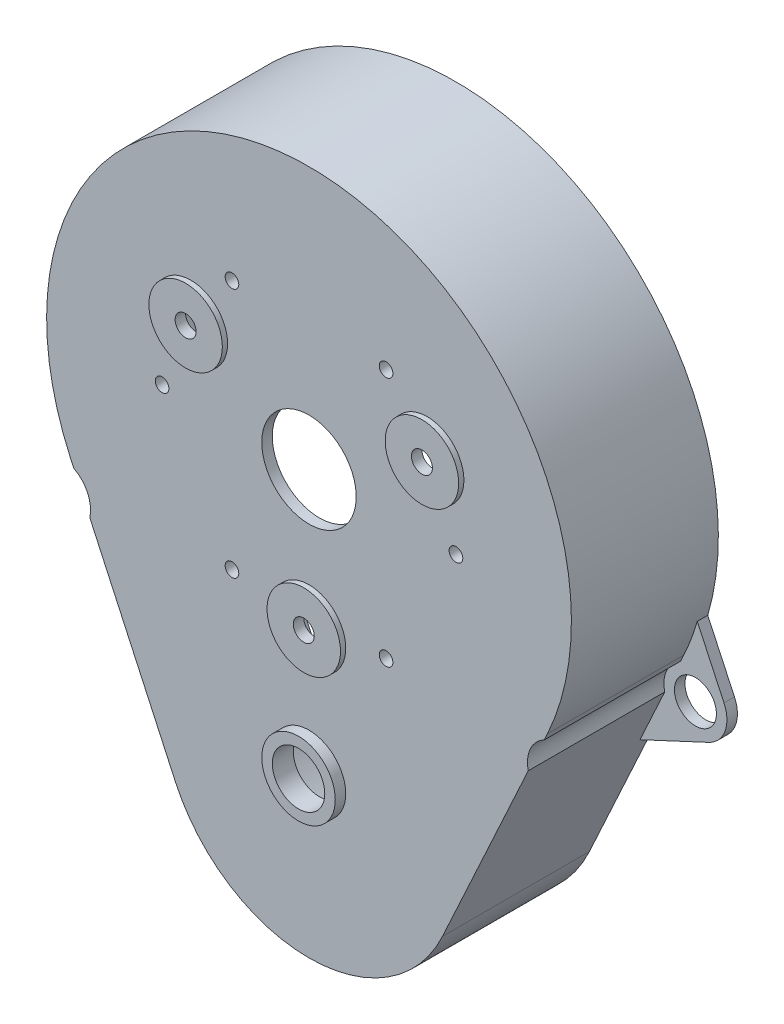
from build123d import *

# Parameters (mm, degrees)
BASE_EXTRUSION_DEPTH         = 14
COQUE1_T                     = -1
ESQUISSE2_R                  = 2
BOSS_EXTRU_1_DEPTH           = 1
ENL_V_MAT_EXTRU_1_DEPTH      = 51.121569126
ENL_V_MAT_EXTRU_2_DEPTH      = 51.121569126
ESQUISSE5_R                  = 0.65
ENL_V_MAT_EXTRU_3_DEPTH      = 51.121569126
ESQUISSE6_R                  = 2.5
ENL_V_MAT_EXTRU_4_DEPTH      = 51.121569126
ESQUISSE7_R                  = 4.5
ENL_V_MAT_EXTRU_5_DEPTH      = 51.121569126
ESQUISSE8_R                  = 3.5
ENL_V_MAT_EXTRU_6_DEPTH      = 0.5
R_P_TITION_CIRCULAIRE1_COUNT = 3
ESQUISSE9_R                  = 3.5
BOSS_EXTRU_2_DEPTH           = 0.5
ESQUISSE10_R                 = 3.5
ESQUISSE10_R_2               = 2.5
BOSS_EXTRU_3_DEPTH           = 1
ESQUISSE11_R                 = 1
ENL_V_MAT_EXTRU_7_DEPTH      = 51.253573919
R_P_TITION_CIRCULAIRE2_COUNT = 3


with BuildPart() as part:
    # Esquisse1 → Base-Extrusion (new body)
    with BuildSketch(Plane.XY):
        with BuildLine():
            Line((12.716641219, -32.155513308), (22.708287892, -10.456273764))
            ThreePointArc((22.708287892, -10.456273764), (0, 25), (-22.708287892, -10.456273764))
            Line((-22.708287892, -10.456273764), (-12.716641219, -32.155513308))
            ThreePointArc((-12.716641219, -32.155513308), (0, -40.3), (12.716641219, -32.155513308))
        make_face()
    extrude(amount=BASE_EXTRUSION_DEPTH)

    # Coque1
    coque1_openings = [part.faces().sort_by_distance(p)[0] for p in [
        (0, -5.432281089, 0),
    ]]
    offset(amount=COQUE1_T, openings=coque1_openings, kind=Kind.INTERSECTION)

    # Esquisse2 → Boss.-Extru.1 (add)
    # profile 1 of 2: a face of its own
    with BuildSketch(Plane(origin=(0, 0, 0), x_dir=(-1, 0, 0), z_dir=(0, 0, -1))):
        with BuildLine():
            Line((23.991621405, -7.028662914), (26.534621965, -12.482145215))
            ThreePointArc((26.534621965, -12.482145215), (26.634776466, -14.77606043), (25.083553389, -16.468923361))
            Line((25.083553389, -16.468923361), (18.53323976, -19.52338477))
            Line((18.53323976, -19.52338477), (22.708287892, -10.456273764))
            ThreePointArc((22.708287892, -10.456273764), (23.41276385, -8.765984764), (23.991621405, -7.028662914))
        make_face()
        with Locations((23.815698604, -13.75)):
            Circle(ESQUISSE2_R, mode=Mode.SUBTRACT)
    # profile 2 of 2: a face of its own
    with BuildSketch(Plane(origin=(0, 0, 0), x_dir=(-1, 0, 0), z_dir=(0, 0, -1))):
        with BuildLine():
            Line((-25.083553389, -16.468923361), (-18.53323976, -19.52338477))
            Line((-18.53323976, -19.52338477), (-22.708287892, -10.456273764))
            ThreePointArc((-22.708287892, -10.456273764), (-23.41276385, -8.765984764), (-23.991621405, -7.028662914))
            Line((-23.991621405, -7.028662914), (-26.534621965, -12.482145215))
            ThreePointArc((-26.534621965, -12.482145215), (-26.634776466, -14.77606043), (-25.083553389, -16.468923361))
        make_face()
        with Locations((-23.815698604, -13.75)):
            Circle(ESQUISSE2_R, mode=Mode.SUBTRACT)
    extrude(amount=-BOSS_EXTRU_1_DEPTH)

    # Esquisse3 → Enl_v. mat.-Extru.1 (cut, through all)
    with BuildSketch(Plane.XY.offset(1)):
        with BuildLine():
            Line((20.888723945, -14.407890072), (22.412656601, -11.098307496))
            ThreePointArc((22.412656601, -11.098307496), (21.090704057, -12.495247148), (20.888723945, -14.407890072))
        make_face()
    extrude(amount=ENL_V_MAT_EXTRU_1_DEPTH, mode=Mode.SUBTRACT)

    # Esquisse4 → Enl_v. mat.-Extru.2 (cut, through all)
    with BuildSketch(Plane.XY.offset(1)):
        with BuildLine():
            Line((-22.412656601, -11.098307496), (-20.888723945, -14.407890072))
            ThreePointArc((-20.888723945, -14.407890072), (-21.090704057, -12.495247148), (-22.412656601, -11.098307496))
        make_face()
    extrude(amount=ENL_V_MAT_EXTRU_2_DEPTH, mode=Mode.SUBTRACT)

    # Esquisse5 → Enl_v. mat.-Extru.3 (cut, through all)
    with BuildSketch(Plane(origin=(0, 0, 13), x_dir=(-1, 0, 0), z_dir=(0, 0, -1))):
        with Locations((7.3425881, 11.92)):
            Circle(ESQUISSE5_R)
        with Locations((14, 0)):
            Circle(ESQUISSE5_R)
        with Locations((7.3425881, -11.92)):
            Circle(ESQUISSE5_R)
        with Locations((-7.3425881, -11.92)):
            Circle(ESQUISSE5_R)
        with Locations((-14, 0)):
            Circle(ESQUISSE5_R)
        with Locations((-7.3425881, 11.92)):
            Circle(ESQUISSE5_R)
    extrude(amount=-ENL_V_MAT_EXTRU_3_DEPTH, mode=Mode.SUBTRACT)

    # Esquisse6 → Enl_v. mat.-Extru.4 (cut, through all)
    with BuildSketch(Plane(origin=(0, 0, 13), x_dir=(-1, 0, 0), z_dir=(0, 0, -1))):
        with Locations((0, -25)):
            Circle(ESQUISSE6_R)
    extrude(amount=-ENL_V_MAT_EXTRU_4_DEPTH, mode=Mode.SUBTRACT)

    # Esquisse7 → Enl_v. mat.-Extru.5 (cut, through all)
    with BuildSketch(Plane(origin=(0, 0, 13), x_dir=(-1, 0, 0), z_dir=(0, 0, -1))):
        Circle(ESQUISSE7_R)
    extrude(amount=-ENL_V_MAT_EXTRU_5_DEPTH, mode=Mode.SUBTRACT)

    # Esquisse8 → Enl_v. mat.-Extru.6 (cut)
    with BuildSketch(Plane(origin=(0, 0, 13), x_dir=(-1, 0, 0), z_dir=(0, 0, -1))):
        with Locations((11.258330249, 6.5)):
            Circle(ESQUISSE8_R)
    enl_v_mat_extru_6 = extrude(amount=-ENL_V_MAT_EXTRU_6_DEPTH, mode=Mode.SUBTRACT)

    # R_p_tition circulaire1: Enl_v. mat.-Extru.6 ×3 about axis
    r_p_tition_circulaire1_axis = Axis((0, 0, 0), (0, 0, -1))
    for i in range(1, R_P_TITION_CIRCULAIRE1_COUNT):
        add(enl_v_mat_extru_6.rotate(r_p_tition_circulaire1_axis, i * 360 / R_P_TITION_CIRCULAIRE1_COUNT), mode=Mode.SUBTRACT)

    # Esquisse9 → Boss.-Extru.2 (add)
    with BuildSketch(Plane.XY.offset(14)):
        with Locations(Location((0, -13, 0), (0, 0, 300))):
            Circle(ESQUISSE9_R)
        with Locations(Location((-11.258330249, 6.5, 0), (0, 0, 180))):
            Circle(ESQUISSE9_R)
        with Locations(Location((11.258330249, 6.5, 0), (0, 0, 60))):
            Circle(ESQUISSE9_R)
    extrude(amount=BOSS_EXTRU_2_DEPTH)

    # Esquisse10 → Boss.-Extru.3 (add)
    with BuildSketch(Plane.XY.offset(14)):
        with Locations((0, -25)):
            Circle(ESQUISSE10_R)
        with Locations(Location((0, -25, 0), (0, 0, 180))):
            Circle(ESQUISSE10_R_2, mode=Mode.SUBTRACT)
    extrude(amount=BOSS_EXTRU_3_DEPTH)

    # Esquisse11 → Enl_v. mat.-Extru.7 (cut, through all)
    with BuildSketch(Plane(origin=(0, 0, 13.5), x_dir=(-1, 0, 0), z_dir=(0, 0, -1))):
        with Locations((11.258330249, 6.5)):
            Circle(ESQUISSE11_R)
    enl_v_mat_extru_7 = extrude(amount=-ENL_V_MAT_EXTRU_7_DEPTH, mode=Mode.SUBTRACT)

    # R_p_tition circulaire2: Enl_v. mat.-Extru.7 ×3 about axis
    r_p_tition_circulaire2_axis = Axis((0, 0, 0), (0, 0, -1))
    for i in range(1, R_P_TITION_CIRCULAIRE2_COUNT):
        add(enl_v_mat_extru_7.rotate(r_p_tition_circulaire2_axis, i * 360 / R_P_TITION_CIRCULAIRE2_COUNT), mode=Mode.SUBTRACT)


solid = part.part
